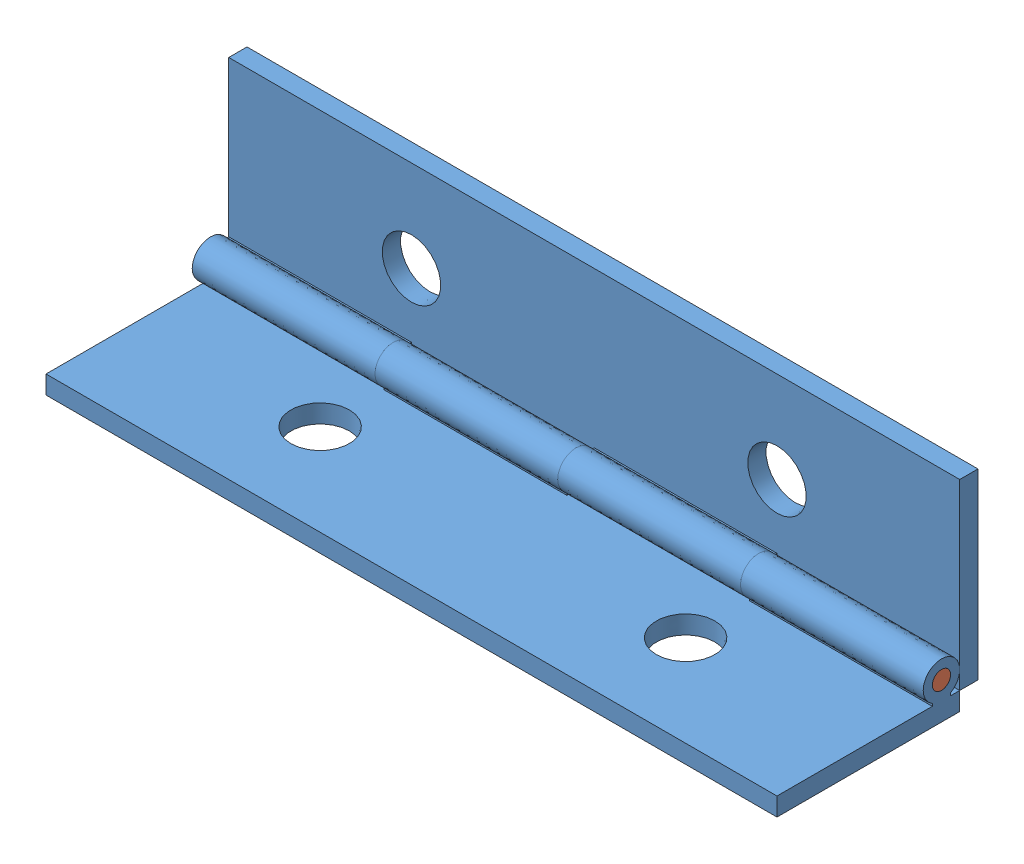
SolidWorks assembly assembledhinge.SLDASM, configuration Default (file format 4100). Lengths in mm.
Overall size (40 11 11).
3 component instances, 2 part files, 5 mates.
Components (placement in the parent):
- Side1-1: Side1.SLDPRT [Default] at (-19.0062 3.8597 7.4071) size (40 3 10)
- hingerod-1: hingerod.SLDPRT [Default] at (20.9938 5.8597 -1.5929) x (0 0.229452 0.97332) z (0 -0.97332 0.229452) size (1 40 1)
- Side1-2: Side1.SLDPRT [Default] at (20.9938 14.8597 -3.5929) x (-1 0 0) z (0 1 0) size (40 3 10)
Mates (geometry in assembly coordinates):
- Coincident1: coincident aligned: plane of Side1-1 through (-19.0062 4.8597 7.4071) normal (-1 0 0); plane of Side1-2 through (-19.0062 14.8597 -2.5929) normal (-1 0 0)
- Concentric1: concentric anti-aligned: cylinder of Side1-1 through (-19.0062 5.8597 -1.5929) axis (1 0 0) radius 0.5; cylinder of Side1-2 through (20.9938 5.8597 -1.5929) axis (-1 0 0) radius 0.5
- Concentric2: concentric anti-aligned: cylinder of hingerod-1 through (-19.0062 5.8597 -1.5929) axis (1 0 0) radius 0.5; cylinder of Side1-2 through (20.9938 5.8597 -1.5929) axis (-1 0 0) radius 0.5
- Coincident2: coincident aligned: plane of hingerod-1 through (-19.0062 5.8597 -1.5929) normal (-1 0 0); plane of Side1-2 through (-19.0062 14.8597 -2.5929) normal (-1 0 0)
- Angle1: planar angle = 1.570796 rad aligned: plane of Side1-1 through (-19.0062 4.8597 -2.5929) normal (0 1 0); plane of Side1-2 through (20.9938 4.8597 -2.5929) normal (0 0 1)
